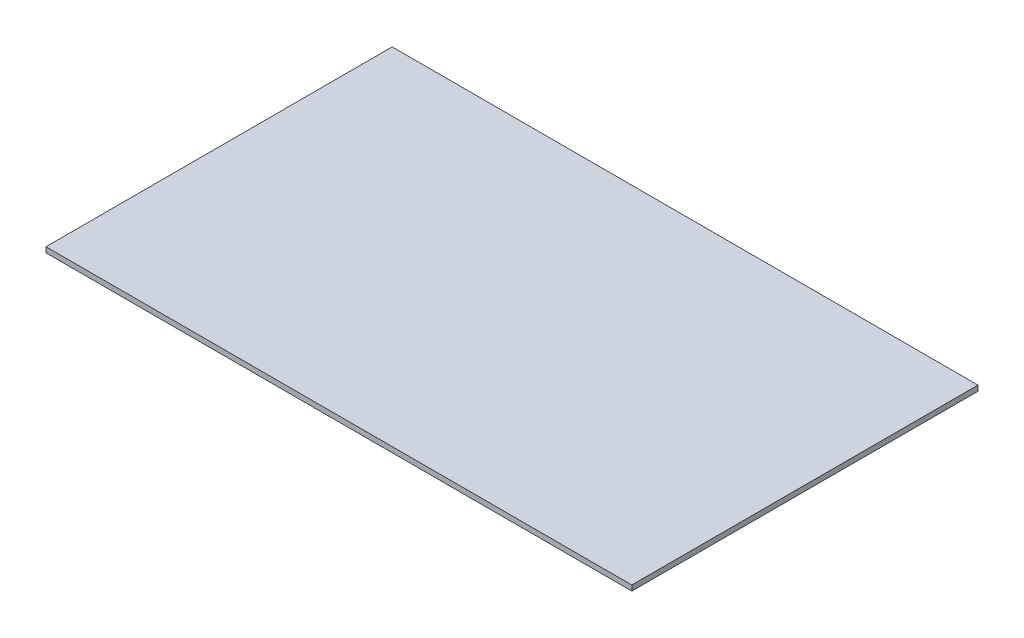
ISO-10303-21;
HEADER;
FILE_DESCRIPTION(('STEP AP214'),'2;1');
FILE_NAME('part.step','',(''),(''),'','','');
FILE_SCHEMA(('AUTOMOTIVE_DESIGN { 1 0 10303 214 1 1 1 1 }'));
ENDSEC;
DATA;
#1=APPLICATION_CONTEXT('core data for automotive mechanical design processes');
#2=APPLICATION_PROTOCOL_DEFINITION('international standard','automotive_design',2000,#1);
#3=PRODUCT_CONTEXT('',#1,'mechanical');
#4=PRODUCT('Part','Part','',(#3));
#5=PRODUCT_RELATED_PRODUCT_CATEGORY('part','',(#4));
#6=PRODUCT_DEFINITION_FORMATION('','',#4);
#7=PRODUCT_DEFINITION_CONTEXT('part definition',#1,'design');
#8=PRODUCT_DEFINITION('design','',#6,#7);
#9=PRODUCT_DEFINITION_SHAPE('','',#8);
#10=(LENGTH_UNIT() NAMED_UNIT(*) SI_UNIT(.MILLI.,.METRE.));
#11=(NAMED_UNIT(*) PLANE_ANGLE_UNIT() SI_UNIT($,.RADIAN.));
#12=(NAMED_UNIT(*) SI_UNIT($,.STERADIAN.) SOLID_ANGLE_UNIT());
#13=UNCERTAINTY_MEASURE_WITH_UNIT(LENGTH_MEASURE(1.E-05),#10,'distance_accuracy_value','');
#14=(GEOMETRIC_REPRESENTATION_CONTEXT(3) GLOBAL_UNCERTAINTY_ASSIGNED_CONTEXT((#13)) GLOBAL_UNIT_ASSIGNED_CONTEXT((#10,
#11,#12)) REPRESENTATION_CONTEXT('',''));
#15=CARTESIAN_POINT('',(0.,0.,0.));
#16=DIRECTION('',(0.,0.,1.));
#17=DIRECTION('',(1.,0.,0.));
#18=AXIS2_PLACEMENT_3D('',#15,#16,#17);
#19=CARTESIAN_POINT('',(110.,2.,-65.));
#20=DIRECTION('',(-1.,0.,0.));
#21=DIRECTION('',(0.,0.,1.));
#22=AXIS2_PLACEMENT_3D('',#19,#20,#21);
#23=PLANE('',#22);
#24=DIRECTION('',(0.,0.,-1.));
#25=VECTOR('',#24,1.);
#26=CARTESIAN_POINT('',(110.,0.,-65.));
#27=LINE('',#26,#25);
#28=CARTESIAN_POINT('',(110.,0.,65.));
#29=VERTEX_POINT('',#28);
#30=CARTESIAN_POINT('',(110.,0.,-65.));
#31=VERTEX_POINT('',#30);
#32=EDGE_CURVE('E95',#29,#31,#27,.T.);
#33=ORIENTED_EDGE('',*,*,#32,.T.);
#34=DIRECTION('',(0.,-1.,0.));
#35=VECTOR('',#34,1.);
#36=CARTESIAN_POINT('',(110.,2.,-65.));
#37=LINE('',#36,#35);
#38=CARTESIAN_POINT('',(110.,2.,-65.));
#39=VERTEX_POINT('',#38);
#40=EDGE_CURVE('E11',#39,#31,#37,.T.);
#41=ORIENTED_EDGE('',*,*,#40,.F.);
#42=DIRECTION('',(0.,0.,-1.));
#43=VECTOR('',#42,1.);
#44=CARTESIAN_POINT('',(110.,2.,-65.));
#45=LINE('',#44,#43);
#46=CARTESIAN_POINT('',(110.,2.,65.));
#47=VERTEX_POINT('',#46);
#48=EDGE_CURVE('E83',#47,#39,#45,.T.);
#49=ORIENTED_EDGE('',*,*,#48,.F.);
#50=DIRECTION('',(0.,-1.,0.));
#51=VECTOR('',#50,1.);
#52=CARTESIAN_POINT('',(110.,2.,65.));
#53=LINE('',#52,#51);
#54=EDGE_CURVE('E91',#47,#29,#53,.T.);
#55=ORIENTED_EDGE('',*,*,#54,.T.);
#56=EDGE_LOOP('',(#33,#41,#49,#55));
#57=FACE_BOUND('',#56,.T.);
#58=ADVANCED_FACE('F32',(#57),#23,.F.);
#59=CARTESIAN_POINT('',(-110.,2.,-65.));
#60=DIRECTION('',(0.,0.,1.));
#61=DIRECTION('',(1.,0.,0.));
#62=AXIS2_PLACEMENT_3D('',#59,#60,#61);
#63=PLANE('',#62);
#64=DIRECTION('',(-1.,0.,0.));
#65=VECTOR('',#64,1.);
#66=CARTESIAN_POINT('',(-110.,0.,-65.));
#67=LINE('',#66,#65);
#68=CARTESIAN_POINT('',(-110.,0.,-65.));
#69=VERTEX_POINT('',#68);
#70=EDGE_CURVE('E87',#31,#69,#67,.T.);
#71=ORIENTED_EDGE('',*,*,#70,.T.);
#72=DIRECTION('',(0.,-1.,0.));
#73=VECTOR('',#72,1.);
#74=CARTESIAN_POINT('',(-110.,2.,-65.));
#75=LINE('',#74,#73);
#76=CARTESIAN_POINT('',(-110.,2.,-65.));
#77=VERTEX_POINT('',#76);
#78=EDGE_CURVE('E40',#77,#69,#75,.T.);
#79=ORIENTED_EDGE('',*,*,#78,.F.);
#80=DIRECTION('',(-1.,0.,0.));
#81=VECTOR('',#80,1.);
#82=CARTESIAN_POINT('',(-110.,2.,-65.));
#83=LINE('',#82,#81);
#84=EDGE_CURVE('E78',#39,#77,#83,.T.);
#85=ORIENTED_EDGE('',*,*,#84,.F.);
#86=ORIENTED_EDGE('',*,*,#40,.T.);
#87=EDGE_LOOP('',(#71,#79,#85,#86));
#88=FACE_BOUND('',#87,.T.);
#89=ADVANCED_FACE('F86',(#88),#63,.F.);
#90=CARTESIAN_POINT('',(-110.,2.,-65.));
#91=DIRECTION('',(1.,0.,0.));
#92=DIRECTION('',(0.,0.,-1.));
#93=AXIS2_PLACEMENT_3D('',#90,#91,#92);
#94=PLANE('',#93);
#95=DIRECTION('',(0.,0.,1.));
#96=VECTOR('',#95,1.);
#97=CARTESIAN_POINT('',(-110.,0.,-65.));
#98=LINE('',#97,#96);
#99=CARTESIAN_POINT('',(-110.,0.,65.));
#100=VERTEX_POINT('',#99);
#101=EDGE_CURVE('E65',#69,#100,#98,.T.);
#102=ORIENTED_EDGE('',*,*,#101,.T.);
#103=DIRECTION('',(0.,-1.,0.));
#104=VECTOR('',#103,1.);
#105=CARTESIAN_POINT('',(-110.,2.,65.));
#106=LINE('',#105,#104);
#107=CARTESIAN_POINT('',(-110.,2.,65.));
#108=VERTEX_POINT('',#107);
#109=EDGE_CURVE('E88',#108,#100,#106,.T.);
#110=ORIENTED_EDGE('',*,*,#109,.F.);
#111=DIRECTION('',(0.,0.,1.));
#112=VECTOR('',#111,1.);
#113=CARTESIAN_POINT('',(-110.,2.,-65.));
#114=LINE('',#113,#112);
#115=EDGE_CURVE('E81',#77,#108,#114,.T.);
#116=ORIENTED_EDGE('',*,*,#115,.F.);
#117=ORIENTED_EDGE('',*,*,#78,.T.);
#118=EDGE_LOOP('',(#102,#110,#116,#117));
#119=FACE_BOUND('',#118,.T.);
#120=ADVANCED_FACE('F89',(#119),#94,.F.);
#121=CARTESIAN_POINT('',(-110.,2.,65.));
#122=DIRECTION('',(0.,0.,-1.));
#123=DIRECTION('',(-1.,0.,0.));
#124=AXIS2_PLACEMENT_3D('',#121,#122,#123);
#125=PLANE('',#124);
#126=DIRECTION('',(1.,0.,0.));
#127=VECTOR('',#126,1.);
#128=CARTESIAN_POINT('',(-110.,0.,65.));
#129=LINE('',#128,#127);
#130=EDGE_CURVE('E71',#100,#29,#129,.T.);
#131=ORIENTED_EDGE('',*,*,#130,.T.);
#132=ORIENTED_EDGE('',*,*,#54,.F.);
#133=DIRECTION('',(1.,0.,0.));
#134=VECTOR('',#133,1.);
#135=CARTESIAN_POINT('',(-110.,2.,65.));
#136=LINE('',#135,#134);
#137=EDGE_CURVE('E48',#108,#47,#136,.T.);
#138=ORIENTED_EDGE('',*,*,#137,.F.);
#139=ORIENTED_EDGE('',*,*,#109,.T.);
#140=EDGE_LOOP('',(#131,#132,#138,#139));
#141=FACE_BOUND('',#140,.T.);
#142=ADVANCED_FACE('F102',(#141),#125,.F.);
#143=CARTESIAN_POINT('',(0.,2.,0.));
#144=DIRECTION('',(0.,1.,0.));
#145=DIRECTION('',(0.,0.,1.));
#146=AXIS2_PLACEMENT_3D('',#143,#144,#145);
#147=PLANE('',#146);
#148=ORIENTED_EDGE('',*,*,#48,.T.);
#149=ORIENTED_EDGE('',*,*,#84,.T.);
#150=ORIENTED_EDGE('',*,*,#115,.T.);
#151=ORIENTED_EDGE('',*,*,#137,.T.);
#152=EDGE_LOOP('',(#148,#149,#150,#151));
#153=FACE_BOUND('',#152,.T.);
#154=ADVANCED_FACE('F79',(#153),#147,.T.);
#155=CARTESIAN_POINT('',(0.,0.,0.));
#156=DIRECTION('',(0.,1.,0.));
#157=DIRECTION('',(0.,0.,1.));
#158=AXIS2_PLACEMENT_3D('',#155,#156,#157);
#159=PLANE('',#158);
#160=ORIENTED_EDGE('',*,*,#32,.F.);
#161=ORIENTED_EDGE('',*,*,#130,.F.);
#162=ORIENTED_EDGE('',*,*,#101,.F.);
#163=ORIENTED_EDGE('',*,*,#70,.F.);
#164=EDGE_LOOP('',(#160,#161,#162,#163));
#165=FACE_BOUND('',#164,.T.);
#166=ADVANCED_FACE('F105',(#165),#159,.F.);
#167=CLOSED_SHELL('',(#58,#89,#120,#142,#154,#166));
#168=MANIFOLD_SOLID_BREP('B2',#167);
#169=ADVANCED_BREP_SHAPE_REPRESENTATION('',(#18,#168),#14);
#170=SHAPE_DEFINITION_REPRESENTATION(#9,#169);
ENDSEC;
END-ISO-10303-21;
